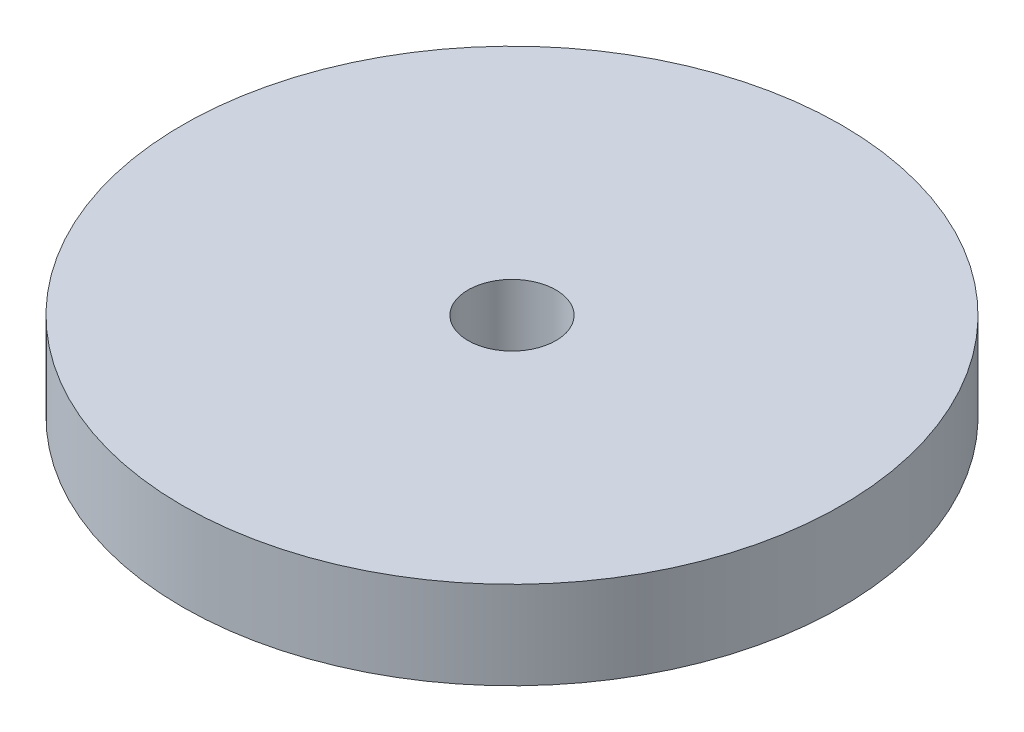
from build123d import *

# Parameters (mm, degrees)
SKETCH1_R      = 22.5
SKETCH1_R_2    = 3
EXTRUDE1_DEPTH = 6


with BuildPart() as part:
    # Sketch1 → Extrude1 (new body)
    with BuildSketch(Plane(origin=(0, 0, 0), x_dir=(1, 0, 0), z_dir=(0, 1, 0))):
        with Locations(Location((0, 0, 0), (0, 0, 270))):
            Circle(SKETCH1_R)
        with Locations(Location((0, 0, 0), (0, 0, 270))):
            Circle(SKETCH1_R_2, mode=Mode.SUBTRACT)
    extrude(amount=EXTRUDE1_DEPTH)


solid = part.part
